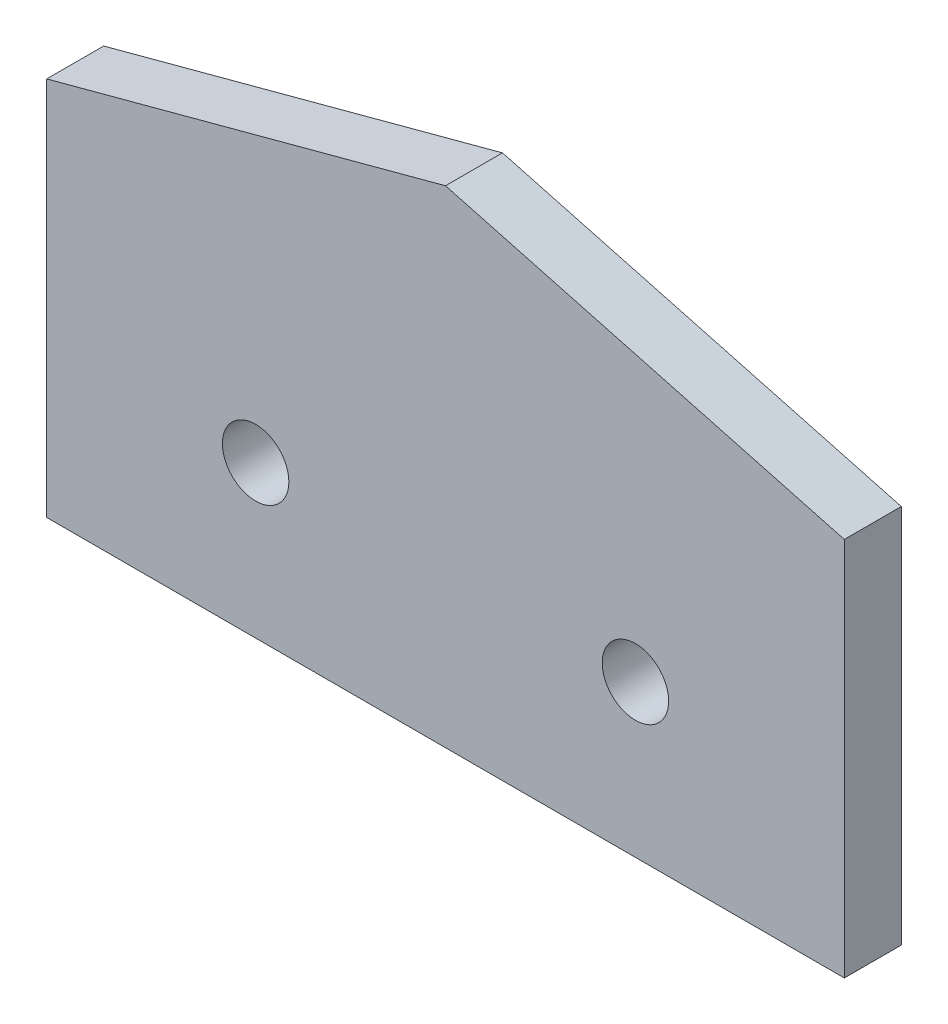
ISO-10303-21;
HEADER;
FILE_DESCRIPTION(('STEP AP214'),'2;1');
FILE_NAME('part.step','',(''),(''),'','','');
FILE_SCHEMA(('AUTOMOTIVE_DESIGN { 1 0 10303 214 1 1 1 1 }'));
ENDSEC;
DATA;
#1=APPLICATION_CONTEXT('core data for automotive mechanical design processes');
#2=APPLICATION_PROTOCOL_DEFINITION('international standard','automotive_design',2000,#1);
#3=PRODUCT_CONTEXT('',#1,'mechanical');
#4=PRODUCT('Part','Part','',(#3));
#5=PRODUCT_RELATED_PRODUCT_CATEGORY('part','',(#4));
#6=PRODUCT_DEFINITION_FORMATION('','',#4);
#7=PRODUCT_DEFINITION_CONTEXT('part definition',#1,'design');
#8=PRODUCT_DEFINITION('design','',#6,#7);
#9=PRODUCT_DEFINITION_SHAPE('','',#8);
#10=(LENGTH_UNIT() NAMED_UNIT(*) SI_UNIT(.MILLI.,.METRE.));
#11=(NAMED_UNIT(*) PLANE_ANGLE_UNIT() SI_UNIT($,.RADIAN.));
#12=(NAMED_UNIT(*) SI_UNIT($,.STERADIAN.) SOLID_ANGLE_UNIT());
#13=UNCERTAINTY_MEASURE_WITH_UNIT(LENGTH_MEASURE(1.E-05),#10,'distance_accuracy_value','');
#14=(GEOMETRIC_REPRESENTATION_CONTEXT(3) GLOBAL_UNCERTAINTY_ASSIGNED_CONTEXT((#13)) GLOBAL_UNIT_ASSIGNED_CONTEXT((#10,
#11,#12)) REPRESENTATION_CONTEXT('',''));
#15=CARTESIAN_POINT('',(0.,0.,0.));
#16=DIRECTION('',(0.,0.,1.));
#17=DIRECTION('',(1.,0.,0.));
#18=AXIS2_PLACEMENT_3D('',#15,#16,#17);
#19=CARTESIAN_POINT('',(0.,0.,3.));
#20=DIRECTION('',(0.,0.,-1.));
#21=DIRECTION('',(-1.,0.,0.));
#22=AXIS2_PLACEMENT_3D('',#19,#20,#21);
#23=PLANE('',#22);
#24=CARTESIAN_POINT('',(11.,8.,3.));
#25=DIRECTION('',(0.,0.,1.));
#26=DIRECTION('',(1.,0.,0.));
#27=AXIS2_PLACEMENT_3D('',#24,#25,#26);
#28=CIRCLE('',#27,1.75);
#29=CARTESIAN_POINT('',(12.75,8.,3.));
#30=VERTEX_POINT('',#29);
#31=EDGE_CURVE('E110',#30,#30,#28,.T.);
#32=ORIENTED_EDGE('',*,*,#31,.F.);
#33=EDGE_LOOP('',(#32));
#34=FACE_BOUND('',#33,.T.);
#35=DIRECTION('',(0.,-1.,0.));
#36=VECTOR('',#35,1.);
#37=CARTESIAN_POINT('',(0.,0.,3.));
#38=LINE('',#37,#36);
#39=CARTESIAN_POINT('',(0.,20.,3.));
#40=VERTEX_POINT('',#39);
#41=CARTESIAN_POINT('',(0.,0.,3.));
#42=VERTEX_POINT('',#41);
#43=EDGE_CURVE('E115',#40,#42,#38,.T.);
#44=ORIENTED_EDGE('',*,*,#43,.T.);
#45=DIRECTION('',(1.,0.,0.));
#46=VECTOR('',#45,1.);
#47=CARTESIAN_POINT('',(0.,0.,3.));
#48=LINE('',#47,#46);
#49=CARTESIAN_POINT('',(42.,0.,3.));
#50=VERTEX_POINT('',#49);
#51=EDGE_CURVE('E82',#42,#50,#48,.T.);
#52=ORIENTED_EDGE('',*,*,#51,.T.);
#53=DIRECTION('',(0.,1.,0.));
#54=VECTOR('',#53,1.);
#55=CARTESIAN_POINT('',(42.,0.,3.));
#56=LINE('',#55,#54);
#57=CARTESIAN_POINT('',(42.,20.,3.));
#58=VERTEX_POINT('',#57);
#59=EDGE_CURVE('E86',#50,#58,#56,.T.);
#60=ORIENTED_EDGE('',*,*,#59,.T.);
#61=DIRECTION('',(-0.965925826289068,0.258819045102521,0.));
#62=VECTOR('',#61,1.);
#63=CARTESIAN_POINT('',(21.,25.6269330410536,3.));
#64=LINE('',#63,#62);
#65=CARTESIAN_POINT('',(21.,25.6269330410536,3.));
#66=VERTEX_POINT('',#65);
#67=EDGE_CURVE('E90',#58,#66,#64,.T.);
#68=ORIENTED_EDGE('',*,*,#67,.T.);
#69=DIRECTION('',(-0.965925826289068,-0.258819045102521,0.));
#70=VECTOR('',#69,1.);
#71=CARTESIAN_POINT('',(0.,20.,3.));
#72=LINE('',#71,#70);
#73=EDGE_CURVE('E48',#66,#40,#72,.T.);
#74=ORIENTED_EDGE('',*,*,#73,.T.);
#75=EDGE_LOOP('',(#44,#52,#60,#68,#74));
#76=FACE_BOUND('',#75,.T.);
#77=CARTESIAN_POINT('',(31.,8.,3.));
#78=DIRECTION('',(0.,0.,1.));
#79=DIRECTION('',(1.,0.,0.));
#80=AXIS2_PLACEMENT_3D('',#77,#78,#79);
#81=CIRCLE('',#80,1.75000000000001);
#82=CARTESIAN_POINT('',(32.75,8.,3.));
#83=VERTEX_POINT('',#82);
#84=EDGE_CURVE('E153',#83,#83,#81,.T.);
#85=ORIENTED_EDGE('',*,*,#84,.F.);
#86=EDGE_LOOP('',(#85));
#87=FACE_BOUND('',#86,.T.);
#88=ADVANCED_FACE('F31',(#34,#76,#87),#23,.F.);
#89=CARTESIAN_POINT('',(0.,0.,0.));
#90=DIRECTION('',(0.,0.,-1.));
#91=DIRECTION('',(-1.,0.,0.));
#92=AXIS2_PLACEMENT_3D('',#89,#90,#91);
#93=PLANE('',#92);
#94=CARTESIAN_POINT('',(11.,8.,0.));
#95=DIRECTION('',(0.,0.,1.));
#96=DIRECTION('',(1.,0.,0.));
#97=AXIS2_PLACEMENT_3D('',#94,#95,#96);
#98=CIRCLE('',#97,1.75);
#99=CARTESIAN_POINT('',(12.75,8.,0.));
#100=VERTEX_POINT('',#99);
#101=EDGE_CURVE('E158',#100,#100,#98,.T.);
#102=ORIENTED_EDGE('',*,*,#101,.T.);
#103=EDGE_LOOP('',(#102));
#104=FACE_BOUND('',#103,.T.);
#105=DIRECTION('',(0.,-1.,0.));
#106=VECTOR('',#105,1.);
#107=CARTESIAN_POINT('',(0.,0.,0.));
#108=LINE('',#107,#106);
#109=CARTESIAN_POINT('',(0.,20.,0.));
#110=VERTEX_POINT('',#109);
#111=CARTESIAN_POINT('',(0.,0.,0.));
#112=VERTEX_POINT('',#111);
#113=EDGE_CURVE('E106',#110,#112,#108,.T.);
#114=ORIENTED_EDGE('',*,*,#113,.F.);
#115=DIRECTION('',(-0.965925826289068,-0.258819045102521,0.));
#116=VECTOR('',#115,1.);
#117=CARTESIAN_POINT('',(0.,20.,0.));
#118=LINE('',#117,#116);
#119=CARTESIAN_POINT('',(21.,25.6269330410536,0.));
#120=VERTEX_POINT('',#119);
#121=EDGE_CURVE('E74',#120,#110,#118,.T.);
#122=ORIENTED_EDGE('',*,*,#121,.F.);
#123=DIRECTION('',(-0.965925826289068,0.258819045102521,0.));
#124=VECTOR('',#123,1.);
#125=CARTESIAN_POINT('',(21.,25.6269330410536,0.));
#126=LINE('',#125,#124);
#127=CARTESIAN_POINT('',(42.,20.,0.));
#128=VERTEX_POINT('',#127);
#129=EDGE_CURVE('E68',#128,#120,#126,.T.);
#130=ORIENTED_EDGE('',*,*,#129,.F.);
#131=DIRECTION('',(0.,1.,0.));
#132=VECTOR('',#131,1.);
#133=CARTESIAN_POINT('',(42.,0.,0.));
#134=LINE('',#133,#132);
#135=CARTESIAN_POINT('',(42.,0.,0.));
#136=VERTEX_POINT('',#135);
#137=EDGE_CURVE('E97',#136,#128,#134,.T.);
#138=ORIENTED_EDGE('',*,*,#137,.F.);
#139=DIRECTION('',(1.,0.,0.));
#140=VECTOR('',#139,1.);
#141=CARTESIAN_POINT('',(0.,0.,0.));
#142=LINE('',#141,#140);
#143=EDGE_CURVE('E109',#112,#136,#142,.T.);
#144=ORIENTED_EDGE('',*,*,#143,.F.);
#145=EDGE_LOOP('',(#114,#122,#130,#138,#144));
#146=FACE_BOUND('',#145,.T.);
#147=CARTESIAN_POINT('',(31.,8.,0.));
#148=DIRECTION('',(0.,0.,1.));
#149=DIRECTION('',(1.,0.,0.));
#150=AXIS2_PLACEMENT_3D('',#147,#148,#149);
#151=CIRCLE('',#150,1.75000000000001);
#152=CARTESIAN_POINT('',(32.75,8.,0.));
#153=VERTEX_POINT('',#152);
#154=EDGE_CURVE('E156',#153,#153,#151,.T.);
#155=ORIENTED_EDGE('',*,*,#154,.T.);
#156=EDGE_LOOP('',(#155));
#157=FACE_BOUND('',#156,.T.);
#158=ADVANCED_FACE('F119',(#104,#146,#157),#93,.T.);
#159=CARTESIAN_POINT('',(0.,0.,3.));
#160=DIRECTION('',(1.,0.,0.));
#161=DIRECTION('',(0.,0.,-1.));
#162=AXIS2_PLACEMENT_3D('',#159,#160,#161);
#163=PLANE('',#162);
#164=ORIENTED_EDGE('',*,*,#113,.T.);
#165=DIRECTION('',(0.,0.,-1.));
#166=VECTOR('',#165,1.);
#167=CARTESIAN_POINT('',(0.,0.,3.));
#168=LINE('',#167,#166);
#169=EDGE_CURVE('E11',#42,#112,#168,.T.);
#170=ORIENTED_EDGE('',*,*,#169,.F.);
#171=ORIENTED_EDGE('',*,*,#43,.F.);
#172=DIRECTION('',(0.,0.,-1.));
#173=VECTOR('',#172,1.);
#174=CARTESIAN_POINT('',(0.,20.,3.));
#175=LINE('',#174,#173);
#176=EDGE_CURVE('E102',#40,#110,#175,.T.);
#177=ORIENTED_EDGE('',*,*,#176,.T.);
#178=EDGE_LOOP('',(#164,#170,#171,#177));
#179=FACE_BOUND('',#178,.T.);
#180=ADVANCED_FACE('F33',(#179),#163,.F.);
#181=CARTESIAN_POINT('',(0.,0.,3.));
#182=DIRECTION('',(0.,1.,0.));
#183=DIRECTION('',(0.,0.,1.));
#184=AXIS2_PLACEMENT_3D('',#181,#182,#183);
#185=PLANE('',#184);
#186=ORIENTED_EDGE('',*,*,#143,.T.);
#187=DIRECTION('',(0.,0.,-1.));
#188=VECTOR('',#187,1.);
#189=CARTESIAN_POINT('',(42.,0.,3.));
#190=LINE('',#189,#188);
#191=EDGE_CURVE('E40',#50,#136,#190,.T.);
#192=ORIENTED_EDGE('',*,*,#191,.F.);
#193=ORIENTED_EDGE('',*,*,#51,.F.);
#194=ORIENTED_EDGE('',*,*,#169,.T.);
#195=EDGE_LOOP('',(#186,#192,#193,#194));
#196=FACE_BOUND('',#195,.T.);
#197=ADVANCED_FACE('F190',(#196),#185,.F.);
#198=CARTESIAN_POINT('',(42.,0.,3.));
#199=DIRECTION('',(-1.,0.,0.));
#200=DIRECTION('',(0.,-1.,0.));
#201=AXIS2_PLACEMENT_3D('',#198,#199,#200);
#202=PLANE('',#201);
#203=ORIENTED_EDGE('',*,*,#137,.T.);
#204=DIRECTION('',(0.,0.,-1.));
#205=VECTOR('',#204,1.);
#206=CARTESIAN_POINT('',(42.,20.,3.));
#207=LINE('',#206,#205);
#208=EDGE_CURVE('E94',#58,#128,#207,.T.);
#209=ORIENTED_EDGE('',*,*,#208,.F.);
#210=ORIENTED_EDGE('',*,*,#59,.F.);
#211=ORIENTED_EDGE('',*,*,#191,.T.);
#212=EDGE_LOOP('',(#203,#209,#210,#211));
#213=FACE_BOUND('',#212,.T.);
#214=ADVANCED_FACE('F95',(#213),#202,.F.);
#215=CARTESIAN_POINT('',(21.,25.6269330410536,3.));
#216=DIRECTION('',(-0.258819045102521,-0.965925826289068,0.));
#217=DIRECTION('',(0.965925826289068,-0.258819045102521,0.));
#218=AXIS2_PLACEMENT_3D('',#215,#216,#217);
#219=PLANE('',#218);
#220=ORIENTED_EDGE('',*,*,#129,.T.);
#221=DIRECTION('',(0.,0.,-1.));
#222=VECTOR('',#221,1.);
#223=CARTESIAN_POINT('',(21.,25.6269330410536,3.));
#224=LINE('',#223,#222);
#225=EDGE_CURVE('E98',#66,#120,#224,.T.);
#226=ORIENTED_EDGE('',*,*,#225,.F.);
#227=ORIENTED_EDGE('',*,*,#67,.F.);
#228=ORIENTED_EDGE('',*,*,#208,.T.);
#229=EDGE_LOOP('',(#220,#226,#227,#228));
#230=FACE_BOUND('',#229,.T.);
#231=ADVANCED_FACE('F100',(#230),#219,.F.);
#232=CARTESIAN_POINT('',(0.,20.,3.));
#233=DIRECTION('',(0.258819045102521,-0.965925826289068,0.));
#234=DIRECTION('',(0.965925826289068,0.258819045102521,0.));
#235=AXIS2_PLACEMENT_3D('',#232,#233,#234);
#236=PLANE('',#235);
#237=ORIENTED_EDGE('',*,*,#121,.T.);
#238=ORIENTED_EDGE('',*,*,#176,.F.);
#239=ORIENTED_EDGE('',*,*,#73,.F.);
#240=ORIENTED_EDGE('',*,*,#225,.T.);
#241=EDGE_LOOP('',(#237,#238,#239,#240));
#242=FACE_BOUND('',#241,.T.);
#243=ADVANCED_FACE('F124',(#242),#236,.F.);
#244=CARTESIAN_POINT('',(11.,8.,3.));
#245=DIRECTION('',(0.,0.,-1.));
#246=DIRECTION('',(-1.,0.,0.));
#247=AXIS2_PLACEMENT_3D('',#244,#245,#246);
#248=CYLINDRICAL_SURFACE('',#247,1.75);
#249=ORIENTED_EDGE('',*,*,#31,.T.);
#250=EDGE_LOOP('',(#249));
#251=FACE_BOUND('',#250,.T.);
#252=ORIENTED_EDGE('',*,*,#101,.F.);
#253=EDGE_LOOP('',(#252));
#254=FACE_BOUND('',#253,.T.);
#255=ADVANCED_FACE('F126',(#251,#254),#248,.F.);
#256=CARTESIAN_POINT('',(31.,8.,3.));
#257=DIRECTION('',(0.,0.,-1.));
#258=DIRECTION('',(-1.,0.,0.));
#259=AXIS2_PLACEMENT_3D('',#256,#257,#258);
#260=CYLINDRICAL_SURFACE('',#259,1.75000000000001);
#261=ORIENTED_EDGE('',*,*,#84,.T.);
#262=EDGE_LOOP('',(#261));
#263=FACE_BOUND('',#262,.T.);
#264=ORIENTED_EDGE('',*,*,#154,.F.);
#265=EDGE_LOOP('',(#264));
#266=FACE_BOUND('',#265,.T.);
#267=ADVANCED_FACE('F132',(#263,#266),#260,.F.);
#268=CLOSED_SHELL('',(#88,#158,#180,#197,#214,#231,#243,#255,#267));
#269=MANIFOLD_SOLID_BREP('B2',#268);
#270=ADVANCED_BREP_SHAPE_REPRESENTATION('',(#18,#269),#14);
#271=SHAPE_DEFINITION_REPRESENTATION(#9,#270);
ENDSEC;
END-ISO-10303-21;
